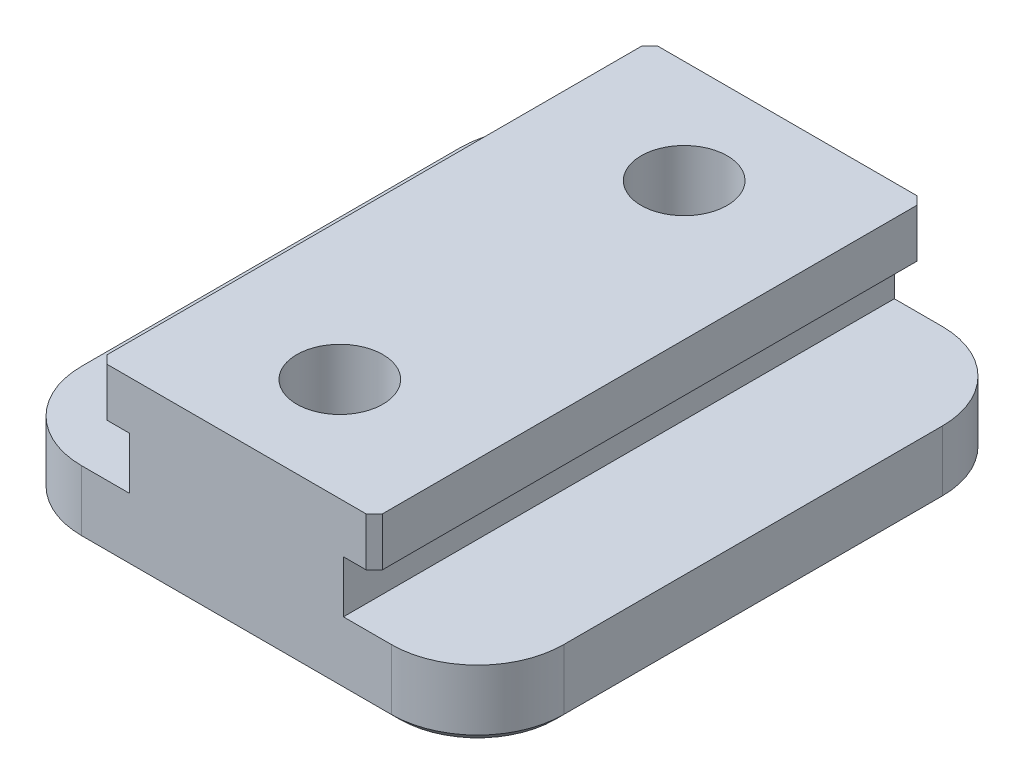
ISO-10303-21;
HEADER;
FILE_DESCRIPTION(('STEP AP214'),'2;1');
FILE_NAME('part.step','',(''),(''),'','','');
FILE_SCHEMA(('AUTOMOTIVE_DESIGN { 1 0 10303 214 1 1 1 1 }'));
ENDSEC;
DATA;
#1=APPLICATION_CONTEXT('core data for automotive mechanical design processes');
#2=APPLICATION_PROTOCOL_DEFINITION('international standard','automotive_design',2000,#1);
#3=PRODUCT_CONTEXT('',#1,'mechanical');
#4=PRODUCT('Part','Part','',(#3));
#5=PRODUCT_RELATED_PRODUCT_CATEGORY('part','',(#4));
#6=PRODUCT_DEFINITION_FORMATION('','',#4);
#7=PRODUCT_DEFINITION_CONTEXT('part definition',#1,'design');
#8=PRODUCT_DEFINITION('design','',#6,#7);
#9=PRODUCT_DEFINITION_SHAPE('','',#8);
#10=(LENGTH_UNIT() NAMED_UNIT(*) SI_UNIT(.MILLI.,.METRE.));
#11=(NAMED_UNIT(*) PLANE_ANGLE_UNIT() SI_UNIT($,.RADIAN.));
#12=(NAMED_UNIT(*) SI_UNIT($,.STERADIAN.) SOLID_ANGLE_UNIT());
#13=UNCERTAINTY_MEASURE_WITH_UNIT(LENGTH_MEASURE(1.E-05),#10,'distance_accuracy_value','');
#14=(GEOMETRIC_REPRESENTATION_CONTEXT(3) GLOBAL_UNCERTAINTY_ASSIGNED_CONTEXT((#13)) GLOBAL_UNIT_ASSIGNED_CONTEXT((#10,
#11,#12)) REPRESENTATION_CONTEXT('',''));
#15=CARTESIAN_POINT('',(0.,0.,0.));
#16=DIRECTION('',(0.,0.,1.));
#17=DIRECTION('',(1.,0.,0.));
#18=AXIS2_PLACEMENT_3D('',#15,#16,#17);
#19=CARTESIAN_POINT('',(-12.7,6.096,25.4));
#20=DIRECTION('',(1.,0.,0.));
#21=DIRECTION('',(0.,0.,-1.));
#22=AXIS2_PLACEMENT_3D('',#19,#20,#21);
#23=PLANE('',#22);
#24=DIRECTION('',(0.,0.,-1.));
#25=VECTOR('',#24,1.);
#26=CARTESIAN_POINT('',(-12.7,6.096,25.4));
#27=LINE('',#26,#25);
#28=CARTESIAN_POINT('',(-12.7,6.096,24.638));
#29=VERTEX_POINT('',#28);
#30=CARTESIAN_POINT('',(-12.7,6.096,-24.638));
#31=VERTEX_POINT('',#30);
#32=EDGE_CURVE('E239',#29,#31,#27,.T.);
#33=ORIENTED_EDGE('',*,*,#32,.T.);
#34=DIRECTION('',(0.,-1.,0.));
#35=VECTOR('',#34,1.);
#36=CARTESIAN_POINT('',(-12.7,6.096,-24.638));
#37=LINE('',#36,#35);
#38=CARTESIAN_POINT('',(-12.7,1.6256,-24.638));
#39=VERTEX_POINT('',#38);
#40=EDGE_CURVE('E385',#31,#39,#37,.T.);
#41=ORIENTED_EDGE('',*,*,#40,.T.);
#42=DIRECTION('',(0.,0.,-1.));
#43=VECTOR('',#42,1.);
#44=CARTESIAN_POINT('',(-12.7,1.6256,25.4));
#45=LINE('',#44,#43);
#46=CARTESIAN_POINT('',(-12.7,1.6256,24.638));
#47=VERTEX_POINT('',#46);
#48=EDGE_CURVE('E219',#47,#39,#45,.T.);
#49=ORIENTED_EDGE('',*,*,#48,.F.);
#50=DIRECTION('',(0.,1.,0.));
#51=VECTOR('',#50,1.);
#52=CARTESIAN_POINT('',(-12.7,6.096,24.638));
#53=LINE('',#52,#51);
#54=EDGE_CURVE('E383',#47,#29,#53,.T.);
#55=ORIENTED_EDGE('',*,*,#54,.T.);
#56=EDGE_LOOP('',(#33,#41,#49,#55));
#57=FACE_BOUND('',#56,.T.);
#58=ADVANCED_FACE('F39',(#57),#23,.F.);
#59=CARTESIAN_POINT('',(-12.7,1.6256,25.4));
#60=DIRECTION('',(0.,1.,0.));
#61=DIRECTION('',(-1.,0.,0.));
#62=AXIS2_PLACEMENT_3D('',#59,#60,#61);
#63=PLANE('',#62);
#64=ORIENTED_EDGE('',*,*,#48,.T.);
#65=DIRECTION('',(-0.707106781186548,0.,0.707106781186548));
#66=VECTOR('',#65,1.);
#67=CARTESIAN_POINT('',(-12.7,1.6256,-24.638));
#68=LINE('',#67,#66);
#69=CARTESIAN_POINT('',(-11.938,1.6256,-25.4));
#70=VERTEX_POINT('',#69);
#71=EDGE_CURVE('E61',#39,#70,#68,.F.);
#72=ORIENTED_EDGE('',*,*,#71,.T.);
#73=DIRECTION('',(1.,0.,0.));
#74=VECTOR('',#73,1.);
#75=CARTESIAN_POINT('',(-12.7,1.6256,-25.4));
#76=LINE('',#75,#74);
#77=CARTESIAN_POINT('',(-9.8552,1.6256,-25.4));
#78=VERTEX_POINT('',#77);
#79=EDGE_CURVE('E216',#70,#78,#76,.T.);
#80=ORIENTED_EDGE('',*,*,#79,.T.);
#81=DIRECTION('',(0.,0.,-1.));
#82=VECTOR('',#81,1.);
#83=CARTESIAN_POINT('',(-9.8552,1.6256,25.4));
#84=LINE('',#83,#82);
#85=CARTESIAN_POINT('',(-9.8552,1.6256,25.4));
#86=VERTEX_POINT('',#85);
#87=EDGE_CURVE('E212',#86,#78,#84,.T.);
#88=ORIENTED_EDGE('',*,*,#87,.F.);
#89=DIRECTION('',(1.,0.,0.));
#90=VECTOR('',#89,1.);
#91=CARTESIAN_POINT('',(-12.7,1.6256,25.4));
#92=LINE('',#91,#90);
#93=CARTESIAN_POINT('',(-11.938,1.6256,25.4));
#94=VERTEX_POINT('',#93);
#95=EDGE_CURVE('E200',#94,#86,#92,.T.);
#96=ORIENTED_EDGE('',*,*,#95,.F.);
#97=DIRECTION('',(-0.707106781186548,0.,-0.707106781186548));
#98=VECTOR('',#97,1.);
#99=CARTESIAN_POINT('',(-11.938,1.6256,25.4));
#100=LINE('',#99,#98);
#101=EDGE_CURVE('E54',#94,#47,#100,.T.);
#102=ORIENTED_EDGE('',*,*,#101,.T.);
#103=EDGE_LOOP('',(#64,#72,#80,#88,#96,#102));
#104=FACE_BOUND('',#103,.T.);
#105=ADVANCED_FACE('F214',(#104),#63,.F.);
#106=CARTESIAN_POINT('',(-9.8552,1.6256,25.4));
#107=DIRECTION('',(1.,0.,0.));
#108=DIRECTION('',(0.,1.,0.));
#109=AXIS2_PLACEMENT_3D('',#106,#107,#108);
#110=PLANE('',#109);
#111=DIRECTION('',(0.,-1.,0.));
#112=VECTOR('',#111,1.);
#113=CARTESIAN_POINT('',(-9.8552,1.6256,-25.4));
#114=LINE('',#113,#112);
#115=CARTESIAN_POINT('',(-9.8552,-3.175,-25.4));
#116=VERTEX_POINT('',#115);
#117=EDGE_CURVE('E241',#78,#116,#114,.T.);
#118=ORIENTED_EDGE('',*,*,#117,.T.);
#119=DIRECTION('',(0.,0.,-1.));
#120=VECTOR('',#119,1.);
#121=CARTESIAN_POINT('',(-9.8552,-3.175,25.4));
#122=LINE('',#121,#120);
#123=CARTESIAN_POINT('',(-9.8552,-3.175,25.4));
#124=VERTEX_POINT('',#123);
#125=EDGE_CURVE('E220',#124,#116,#122,.T.);
#126=ORIENTED_EDGE('',*,*,#125,.F.);
#127=DIRECTION('',(0.,-1.,0.));
#128=VECTOR('',#127,1.);
#129=CARTESIAN_POINT('',(-9.8552,1.6256,25.4));
#130=LINE('',#129,#128);
#131=EDGE_CURVE('E206',#86,#124,#130,.T.);
#132=ORIENTED_EDGE('',*,*,#131,.F.);
#133=ORIENTED_EDGE('',*,*,#87,.T.);
#134=EDGE_LOOP('',(#118,#126,#132,#133));
#135=FACE_BOUND('',#134,.T.);
#136=ADVANCED_FACE('F222',(#135),#110,.F.);
#137=CARTESIAN_POINT('',(-9.8552,-3.175,25.4));
#138=DIRECTION('',(0.,-1.,0.));
#139=DIRECTION('',(1.,0.,0.));
#140=AXIS2_PLACEMENT_3D('',#137,#138,#139);
#141=PLANE('',#140);
#142=DIRECTION('',(0.,0.,-1.));
#143=VECTOR('',#142,1.);
#144=CARTESIAN_POINT('',(-22.225,-3.175,25.4));
#145=LINE('',#144,#143);
#146=CARTESIAN_POINT('',(-22.225,-3.175,17.4498));
#147=VERTEX_POINT('',#146);
#148=CARTESIAN_POINT('',(-22.225,-3.175,-17.4498));
#149=VERTEX_POINT('',#148);
#150=EDGE_CURVE('E273',#147,#149,#145,.T.);
#151=ORIENTED_EDGE('',*,*,#150,.F.);
#152=CARTESIAN_POINT('',(-14.2748,-3.175,17.4498));
#153=DIRECTION('',(0.,-1.,0.));
#154=DIRECTION('',(1.,0.,0.));
#155=AXIS2_PLACEMENT_3D('',#152,#153,#154);
#156=CIRCLE('',#155,7.9502);
#157=CARTESIAN_POINT('',(-14.2748,-3.175,25.4));
#158=VERTEX_POINT('',#157);
#159=EDGE_CURVE('E290',#147,#158,#156,.F.);
#160=ORIENTED_EDGE('',*,*,#159,.T.);
#161=DIRECTION('',(-1.,0.,0.));
#162=VECTOR('',#161,1.);
#163=CARTESIAN_POINT('',(-9.8552,-3.175,25.4));
#164=LINE('',#163,#162);
#165=EDGE_CURVE('E225',#124,#158,#164,.T.);
#166=ORIENTED_EDGE('',*,*,#165,.F.);
#167=ORIENTED_EDGE('',*,*,#125,.T.);
#168=DIRECTION('',(-1.,0.,0.));
#169=VECTOR('',#168,1.);
#170=CARTESIAN_POINT('',(-9.8552,-3.175,-25.4));
#171=LINE('',#170,#169);
#172=CARTESIAN_POINT('',(-14.2748,-3.175,-25.4));
#173=VERTEX_POINT('',#172);
#174=EDGE_CURVE('E244',#116,#173,#171,.T.);
#175=ORIENTED_EDGE('',*,*,#174,.T.);
#176=CARTESIAN_POINT('',(-14.2748,-3.175,-17.4498));
#177=DIRECTION('',(0.,-1.,0.));
#178=DIRECTION('',(1.,0.,0.));
#179=AXIS2_PLACEMENT_3D('',#176,#177,#178);
#180=CIRCLE('',#179,7.9502);
#181=EDGE_CURVE('E288',#173,#149,#180,.F.);
#182=ORIENTED_EDGE('',*,*,#181,.T.);
#183=EDGE_LOOP('',(#151,#160,#166,#167,#175,#182));
#184=FACE_BOUND('',#183,.T.);
#185=ADVANCED_FACE('F765',(#184),#141,.F.);
#186=CARTESIAN_POINT('',(-22.225,-3.175,25.4));
#187=DIRECTION('',(1.,0.,0.));
#188=DIRECTION('',(0.,0.,-1.));
#189=AXIS2_PLACEMENT_3D('',#186,#187,#188);
#190=PLANE('',#189);
#191=DIRECTION('',(0.,-1.,0.));
#192=VECTOR('',#191,1.);
#193=CARTESIAN_POINT('',(-22.225,-3.175,-17.4498));
#194=LINE('',#193,#192);
#195=CARTESIAN_POINT('',(-22.225,-8.763,-17.4498));
#196=VERTEX_POINT('',#195);
#197=EDGE_CURVE('E283',#149,#196,#194,.T.);
#198=ORIENTED_EDGE('',*,*,#197,.T.);
#199=DIRECTION('',(0.,0.,1.));
#200=VECTOR('',#199,1.);
#201=CARTESIAN_POINT('',(-22.225,-8.763,25.4));
#202=LINE('',#201,#200);
#203=CARTESIAN_POINT('',(-22.225,-8.763,17.4498));
#204=VERTEX_POINT('',#203);
#205=EDGE_CURVE('E330',#196,#204,#202,.T.);
#206=ORIENTED_EDGE('',*,*,#205,.T.);
#207=DIRECTION('',(0.,-1.,0.));
#208=VECTOR('',#207,1.);
#209=CARTESIAN_POINT('',(-22.225,-3.175,17.4498));
#210=LINE('',#209,#208);
#211=EDGE_CURVE('E286',#204,#147,#210,.F.);
#212=ORIENTED_EDGE('',*,*,#211,.T.);
#213=ORIENTED_EDGE('',*,*,#150,.T.);
#214=EDGE_LOOP('',(#198,#206,#212,#213));
#215=FACE_BOUND('',#214,.T.);
#216=ADVANCED_FACE('F463',(#215),#190,.F.);
#217=CARTESIAN_POINT('',(-22.225,-9.525,25.4));
#218=DIRECTION('',(0.,1.,0.));
#219=DIRECTION('',(0.,0.,1.));
#220=AXIS2_PLACEMENT_3D('',#217,#218,#219);
#221=PLANE('',#220);
#222=CARTESIAN_POINT('',(0.,-9.525,15.875));
#223=DIRECTION('',(0.,-1.,0.));
#224=DIRECTION('',(0.,0.,-1.));
#225=AXIS2_PLACEMENT_3D('',#222,#223,#224);
#226=CIRCLE('',#225,3.96875);
#227=CARTESIAN_POINT('',(0.,-9.525,11.90625));
#228=VERTEX_POINT('',#227);
#229=EDGE_CURVE('E831',#228,#228,#226,.T.);
#230=ORIENTED_EDGE('',*,*,#229,.F.);
#231=EDGE_LOOP('',(#230));
#232=FACE_BOUND('',#231,.T.);
#233=CARTESIAN_POINT('',(0.,-9.525,-15.875));
#234=DIRECTION('',(0.,-1.,0.));
#235=DIRECTION('',(0.,0.,-1.));
#236=AXIS2_PLACEMENT_3D('',#233,#234,#235);
#237=CIRCLE('',#236,3.96875);
#238=CARTESIAN_POINT('',(0.,-9.525,-19.84375));
#239=VERTEX_POINT('',#238);
#240=EDGE_CURVE('E834',#239,#239,#237,.T.);
#241=ORIENTED_EDGE('',*,*,#240,.F.);
#242=EDGE_LOOP('',(#241));
#243=FACE_BOUND('',#242,.T.);
#244=CARTESIAN_POINT('',(-14.2748,-9.525,-17.4498));
#245=DIRECTION('',(0.,1.,0.));
#246=DIRECTION('',(0.,0.,1.));
#247=AXIS2_PLACEMENT_3D('',#244,#245,#246);
#248=CIRCLE('',#247,7.1882);
#249=CARTESIAN_POINT('',(-21.463,-9.525,-17.4498));
#250=VERTEX_POINT('',#249);
#251=CARTESIAN_POINT('',(-14.2748,-9.525,-24.638));
#252=VERTEX_POINT('',#251);
#253=EDGE_CURVE('E318',#250,#252,#248,.F.);
#254=ORIENTED_EDGE('',*,*,#253,.T.);
#255=DIRECTION('',(1.,0.,0.));
#256=VECTOR('',#255,1.);
#257=CARTESIAN_POINT('',(-22.225,-9.525,-24.638));
#258=LINE('',#257,#256);
#259=CARTESIAN_POINT('',(14.2748,-9.525,-24.638));
#260=VERTEX_POINT('',#259);
#261=EDGE_CURVE('E320',#252,#260,#258,.T.);
#262=ORIENTED_EDGE('',*,*,#261,.T.);
#263=CARTESIAN_POINT('',(14.2748,-9.525,-17.4498));
#264=DIRECTION('',(0.,1.,0.));
#265=DIRECTION('',(0.,0.,1.));
#266=AXIS2_PLACEMENT_3D('',#263,#264,#265);
#267=CIRCLE('',#266,7.1882);
#268=CARTESIAN_POINT('',(21.463,-9.525,-17.4498));
#269=VERTEX_POINT('',#268);
#270=EDGE_CURVE('E316',#260,#269,#267,.F.);
#271=ORIENTED_EDGE('',*,*,#270,.T.);
#272=DIRECTION('',(0.,0.,1.));
#273=VECTOR('',#272,1.);
#274=CARTESIAN_POINT('',(21.463,-9.525,25.4));
#275=LINE('',#274,#273);
#276=CARTESIAN_POINT('',(21.463,-9.525,17.4498));
#277=VERTEX_POINT('',#276);
#278=EDGE_CURVE('E312',#269,#277,#275,.T.);
#279=ORIENTED_EDGE('',*,*,#278,.T.);
#280=CARTESIAN_POINT('',(14.2748,-9.525,17.4498));
#281=DIRECTION('',(0.,1.,0.));
#282=DIRECTION('',(0.,0.,1.));
#283=AXIS2_PLACEMENT_3D('',#280,#281,#282);
#284=CIRCLE('',#283,7.1882);
#285=CARTESIAN_POINT('',(14.2748,-9.525,24.638));
#286=VERTEX_POINT('',#285);
#287=EDGE_CURVE('E308',#277,#286,#284,.F.);
#288=ORIENTED_EDGE('',*,*,#287,.T.);
#289=DIRECTION('',(-1.,0.,0.));
#290=VECTOR('',#289,1.);
#291=CARTESIAN_POINT('',(-14.2748,-9.525,24.638));
#292=LINE('',#291,#290);
#293=CARTESIAN_POINT('',(-14.2748,-9.525,24.638));
#294=VERTEX_POINT('',#293);
#295=EDGE_CURVE('E306',#286,#294,#292,.T.);
#296=ORIENTED_EDGE('',*,*,#295,.T.);
#297=CARTESIAN_POINT('',(-14.2748,-9.525,17.4498));
#298=DIRECTION('',(0.,1.,0.));
#299=DIRECTION('',(0.,0.,1.));
#300=AXIS2_PLACEMENT_3D('',#297,#298,#299);
#301=CIRCLE('',#300,7.1882);
#302=CARTESIAN_POINT('',(-21.463,-9.525,17.4498));
#303=VERTEX_POINT('',#302);
#304=EDGE_CURVE('E310',#294,#303,#301,.F.);
#305=ORIENTED_EDGE('',*,*,#304,.T.);
#306=DIRECTION('',(0.,0.,-1.));
#307=VECTOR('',#306,1.);
#308=CARTESIAN_POINT('',(-21.463,-9.525,25.4));
#309=LINE('',#308,#307);
#310=EDGE_CURVE('E314',#303,#250,#309,.T.);
#311=ORIENTED_EDGE('',*,*,#310,.T.);
#312=EDGE_LOOP('',(#254,#262,#271,#279,#288,#296,#305,#311));
#313=FACE_BOUND('',#312,.T.);
#314=ADVANCED_FACE('F451',(#232,#243,#313),#221,.F.);
#315=CARTESIAN_POINT('',(22.225,-3.175,25.4));
#316=DIRECTION('',(-1.,0.,0.));
#317=DIRECTION('',(0.,0.,1.));
#318=AXIS2_PLACEMENT_3D('',#315,#316,#317);
#319=PLANE('',#318);
#320=DIRECTION('',(0.,1.,0.));
#321=VECTOR('',#320,1.);
#322=CARTESIAN_POINT('',(22.225,-9.525,17.4498));
#323=LINE('',#322,#321);
#324=CARTESIAN_POINT('',(22.225,-3.175,17.4498));
#325=VERTEX_POINT('',#324);
#326=CARTESIAN_POINT('',(22.225,-8.763,17.4498));
#327=VERTEX_POINT('',#326);
#328=EDGE_CURVE('E297',#325,#327,#323,.F.);
#329=ORIENTED_EDGE('',*,*,#328,.T.);
#330=DIRECTION('',(0.,0.,-1.));
#331=VECTOR('',#330,1.);
#332=CARTESIAN_POINT('',(22.225,-8.763,25.4));
#333=LINE('',#332,#331);
#334=CARTESIAN_POINT('',(22.225,-8.763,-17.4498));
#335=VERTEX_POINT('',#334);
#336=EDGE_CURVE('E332',#327,#335,#333,.T.);
#337=ORIENTED_EDGE('',*,*,#336,.T.);
#338=DIRECTION('',(0.,1.,0.));
#339=VECTOR('',#338,1.);
#340=CARTESIAN_POINT('',(22.225,-3.175,-17.4498));
#341=LINE('',#340,#339);
#342=CARTESIAN_POINT('',(22.225,-3.175,-17.4498));
#343=VERTEX_POINT('',#342);
#344=EDGE_CURVE('E300',#335,#343,#341,.T.);
#345=ORIENTED_EDGE('',*,*,#344,.T.);
#346=DIRECTION('',(0.,0.,-1.));
#347=VECTOR('',#346,1.);
#348=CARTESIAN_POINT('',(22.225,-3.175,25.4));
#349=LINE('',#348,#347);
#350=EDGE_CURVE('E270',#325,#343,#349,.T.);
#351=ORIENTED_EDGE('',*,*,#350,.F.);
#352=EDGE_LOOP('',(#329,#337,#345,#351));
#353=FACE_BOUND('',#352,.T.);
#354=ADVANCED_FACE('F495',(#353),#319,.F.);
#355=CARTESIAN_POINT('',(9.8552,-3.175,25.4));
#356=DIRECTION('',(0.,-1.,0.));
#357=DIRECTION('',(1.,0.,0.));
#358=AXIS2_PLACEMENT_3D('',#355,#356,#357);
#359=PLANE('',#358);
#360=ORIENTED_EDGE('',*,*,#350,.T.);
#361=CARTESIAN_POINT('',(14.2748,-3.175,-17.4498));
#362=DIRECTION('',(0.,-1.,0.));
#363=DIRECTION('',(1.,0.,0.));
#364=AXIS2_PLACEMENT_3D('',#361,#362,#363);
#365=CIRCLE('',#364,7.9502);
#366=CARTESIAN_POINT('',(14.2748,-3.175,-25.4));
#367=VERTEX_POINT('',#366);
#368=EDGE_CURVE('E304',#343,#367,#365,.F.);
#369=ORIENTED_EDGE('',*,*,#368,.T.);
#370=DIRECTION('',(-1.,0.,0.));
#371=VECTOR('',#370,1.);
#372=CARTESIAN_POINT('',(9.8552,-3.175,-25.4));
#373=LINE('',#372,#371);
#374=CARTESIAN_POINT('',(9.8552,-3.175,-25.4));
#375=VERTEX_POINT('',#374);
#376=EDGE_CURVE('E247',#367,#375,#373,.T.);
#377=ORIENTED_EDGE('',*,*,#376,.T.);
#378=DIRECTION('',(0.,0.,-1.));
#379=VECTOR('',#378,1.);
#380=CARTESIAN_POINT('',(9.8552,-3.175,25.4));
#381=LINE('',#380,#379);
#382=CARTESIAN_POINT('',(9.8552,-3.175,25.4));
#383=VERTEX_POINT('',#382);
#384=EDGE_CURVE('E267',#383,#375,#381,.T.);
#385=ORIENTED_EDGE('',*,*,#384,.F.);
#386=DIRECTION('',(-1.,0.,0.));
#387=VECTOR('',#386,1.);
#388=CARTESIAN_POINT('',(9.8552,-3.175,25.4));
#389=LINE('',#388,#387);
#390=CARTESIAN_POINT('',(14.2748,-3.175,25.4));
#391=VERTEX_POINT('',#390);
#392=EDGE_CURVE('E227',#391,#383,#389,.T.);
#393=ORIENTED_EDGE('',*,*,#392,.F.);
#394=CARTESIAN_POINT('',(14.2748,-3.175,17.4498));
#395=DIRECTION('',(0.,-1.,0.));
#396=DIRECTION('',(1.,0.,0.));
#397=AXIS2_PLACEMENT_3D('',#394,#395,#396);
#398=CIRCLE('',#397,7.9502);
#399=EDGE_CURVE('E302',#391,#325,#398,.F.);
#400=ORIENTED_EDGE('',*,*,#399,.T.);
#401=EDGE_LOOP('',(#360,#369,#377,#385,#393,#400));
#402=FACE_BOUND('',#401,.T.);
#403=ADVANCED_FACE('F430',(#402),#359,.F.);
#404=CARTESIAN_POINT('',(9.8552,1.6256,25.4));
#405=DIRECTION('',(-1.,0.,0.));
#406=DIRECTION('',(0.,-1.,0.));
#407=AXIS2_PLACEMENT_3D('',#404,#405,#406);
#408=PLANE('',#407);
#409=DIRECTION('',(0.,1.,0.));
#410=VECTOR('',#409,1.);
#411=CARTESIAN_POINT('',(9.8552,1.6256,-25.4));
#412=LINE('',#411,#410);
#413=CARTESIAN_POINT('',(9.8552,1.6256,-25.4));
#414=VERTEX_POINT('',#413);
#415=EDGE_CURVE('E249',#375,#414,#412,.T.);
#416=ORIENTED_EDGE('',*,*,#415,.T.);
#417=DIRECTION('',(0.,0.,-1.));
#418=VECTOR('',#417,1.);
#419=CARTESIAN_POINT('',(9.8552,1.6256,25.4));
#420=LINE('',#419,#418);
#421=CARTESIAN_POINT('',(9.8552,1.6256,25.4));
#422=VERTEX_POINT('',#421);
#423=EDGE_CURVE('E264',#422,#414,#420,.T.);
#424=ORIENTED_EDGE('',*,*,#423,.F.);
#425=DIRECTION('',(0.,1.,0.));
#426=VECTOR('',#425,1.);
#427=CARTESIAN_POINT('',(9.8552,1.6256,25.4));
#428=LINE('',#427,#426);
#429=EDGE_CURVE('E232',#383,#422,#428,.T.);
#430=ORIENTED_EDGE('',*,*,#429,.F.);
#431=ORIENTED_EDGE('',*,*,#384,.T.);
#432=EDGE_LOOP('',(#416,#424,#430,#431));
#433=FACE_BOUND('',#432,.T.);
#434=ADVANCED_FACE('F426',(#433),#408,.F.);
#435=CARTESIAN_POINT('',(12.7,1.6256,25.4));
#436=DIRECTION('',(0.,1.,0.));
#437=DIRECTION('',(0.,0.,1.));
#438=AXIS2_PLACEMENT_3D('',#435,#436,#437);
#439=PLANE('',#438);
#440=DIRECTION('',(1.,0.,0.));
#441=VECTOR('',#440,1.);
#442=CARTESIAN_POINT('',(12.7,1.6256,-25.4));
#443=LINE('',#442,#441);
#444=CARTESIAN_POINT('',(11.938,1.6256,-25.4));
#445=VERTEX_POINT('',#444);
#446=EDGE_CURVE('E251',#414,#445,#443,.T.);
#447=ORIENTED_EDGE('',*,*,#446,.T.);
#448=DIRECTION('',(-0.707106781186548,0.,-0.707106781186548));
#449=VECTOR('',#448,1.);
#450=CARTESIAN_POINT('',(12.7,1.6256,-24.638));
#451=LINE('',#450,#449);
#452=CARTESIAN_POINT('',(12.7,1.6256,-24.638));
#453=VERTEX_POINT('',#452);
#454=EDGE_CURVE('E381',#445,#453,#451,.F.);
#455=ORIENTED_EDGE('',*,*,#454,.T.);
#456=DIRECTION('',(0.,0.,-1.));
#457=VECTOR('',#456,1.);
#458=CARTESIAN_POINT('',(12.7,1.6256,25.4));
#459=LINE('',#458,#457);
#460=CARTESIAN_POINT('',(12.7,1.6256,24.638));
#461=VERTEX_POINT('',#460);
#462=EDGE_CURVE('E261',#461,#453,#459,.T.);
#463=ORIENTED_EDGE('',*,*,#462,.F.);
#464=DIRECTION('',(-0.707106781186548,0.,0.707106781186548));
#465=VECTOR('',#464,1.);
#466=CARTESIAN_POINT('',(11.938,1.6256,25.4));
#467=LINE('',#466,#465);
#468=CARTESIAN_POINT('',(11.938,1.6256,25.4));
#469=VERTEX_POINT('',#468);
#470=EDGE_CURVE('E379',#461,#469,#467,.T.);
#471=ORIENTED_EDGE('',*,*,#470,.T.);
#472=DIRECTION('',(1.,0.,0.));
#473=VECTOR('',#472,1.);
#474=CARTESIAN_POINT('',(12.7,1.6256,25.4));
#475=LINE('',#474,#473);
#476=EDGE_CURVE('E234',#422,#469,#475,.T.);
#477=ORIENTED_EDGE('',*,*,#476,.F.);
#478=ORIENTED_EDGE('',*,*,#423,.T.);
#479=EDGE_LOOP('',(#447,#455,#463,#471,#477,#478));
#480=FACE_BOUND('',#479,.T.);
#481=ADVANCED_FACE('F416',(#480),#439,.F.);
#482=CARTESIAN_POINT('',(12.7,6.096,25.4));
#483=DIRECTION('',(-1.,0.,0.));
#484=DIRECTION('',(0.,0.,1.));
#485=AXIS2_PLACEMENT_3D('',#482,#483,#484);
#486=PLANE('',#485);
#487=ORIENTED_EDGE('',*,*,#462,.T.);
#488=DIRECTION('',(0.,1.,0.));
#489=VECTOR('',#488,1.);
#490=CARTESIAN_POINT('',(12.7,6.096,-24.638));
#491=LINE('',#490,#489);
#492=CARTESIAN_POINT('',(12.7,6.096,-24.638));
#493=VERTEX_POINT('',#492);
#494=EDGE_CURVE('E364',#453,#493,#491,.T.);
#495=ORIENTED_EDGE('',*,*,#494,.T.);
#496=DIRECTION('',(0.,0.,-1.));
#497=VECTOR('',#496,1.);
#498=CARTESIAN_POINT('',(12.7,6.096,25.4));
#499=LINE('',#498,#497);
#500=CARTESIAN_POINT('',(12.7,6.096,24.638));
#501=VERTEX_POINT('',#500);
#502=EDGE_CURVE('E258',#501,#493,#499,.T.);
#503=ORIENTED_EDGE('',*,*,#502,.F.);
#504=DIRECTION('',(0.,-1.,0.));
#505=VECTOR('',#504,1.);
#506=CARTESIAN_POINT('',(12.7,1.6256,24.638));
#507=LINE('',#506,#505);
#508=EDGE_CURVE('E340',#501,#461,#507,.T.);
#509=ORIENTED_EDGE('',*,*,#508,.T.);
#510=EDGE_LOOP('',(#487,#495,#503,#509));
#511=FACE_BOUND('',#510,.T.);
#512=ADVANCED_FACE('F418',(#511),#486,.F.);
#513=CARTESIAN_POINT('',(12.7,6.096,25.4));
#514=DIRECTION('',(0.,-1.,0.));
#515=DIRECTION('',(0.,0.,-1.));
#516=AXIS2_PLACEMENT_3D('',#513,#514,#515);
#517=PLANE('',#516);
#518=CARTESIAN_POINT('',(0.,6.096,15.875));
#519=DIRECTION('',(0.,-1.,0.));
#520=DIRECTION('',(0.,0.,-1.));
#521=AXIS2_PLACEMENT_3D('',#518,#519,#520);
#522=CIRCLE('',#521,3.96875);
#523=CARTESIAN_POINT('',(0.,6.096,11.90625));
#524=VERTEX_POINT('',#523);
#525=EDGE_CURVE('E836',#524,#524,#522,.T.);
#526=ORIENTED_EDGE('',*,*,#525,.T.);
#527=EDGE_LOOP('',(#526));
#528=FACE_BOUND('',#527,.T.);
#529=CARTESIAN_POINT('',(0.,6.096,-15.875));
#530=DIRECTION('',(0.,-1.,0.));
#531=DIRECTION('',(0.,0.,-1.));
#532=AXIS2_PLACEMENT_3D('',#529,#530,#531);
#533=CIRCLE('',#532,3.96875);
#534=CARTESIAN_POINT('',(0.,6.096,-19.84375));
#535=VERTEX_POINT('',#534);
#536=EDGE_CURVE('E344',#535,#535,#533,.T.);
#537=ORIENTED_EDGE('',*,*,#536,.T.);
#538=EDGE_LOOP('',(#537));
#539=FACE_BOUND('',#538,.T.);
#540=ORIENTED_EDGE('',*,*,#502,.T.);
#541=DIRECTION('',(0.707106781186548,0.,0.707106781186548));
#542=VECTOR('',#541,1.);
#543=CARTESIAN_POINT('',(12.7,6.096,-24.638));
#544=LINE('',#543,#542);
#545=CARTESIAN_POINT('',(11.938,6.096,-25.4));
#546=VERTEX_POINT('',#545);
#547=EDGE_CURVE('E373',#493,#546,#544,.F.);
#548=ORIENTED_EDGE('',*,*,#547,.T.);
#549=DIRECTION('',(-1.,0.,0.));
#550=VECTOR('',#549,1.);
#551=CARTESIAN_POINT('',(12.7,6.096,-25.4));
#552=LINE('',#551,#550);
#553=CARTESIAN_POINT('',(-11.938,6.096,-25.4));
#554=VERTEX_POINT('',#553);
#555=EDGE_CURVE('E209',#546,#554,#552,.T.);
#556=ORIENTED_EDGE('',*,*,#555,.T.);
#557=DIRECTION('',(0.707106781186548,0.,-0.707106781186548));
#558=VECTOR('',#557,1.);
#559=CARTESIAN_POINT('',(-12.7,6.096,-24.638));
#560=LINE('',#559,#558);
#561=EDGE_CURVE('E371',#554,#31,#560,.F.);
#562=ORIENTED_EDGE('',*,*,#561,.T.);
#563=ORIENTED_EDGE('',*,*,#32,.F.);
#564=DIRECTION('',(0.707106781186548,0.,0.707106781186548));
#565=VECTOR('',#564,1.);
#566=CARTESIAN_POINT('',(-11.938,6.096,25.4));
#567=LINE('',#566,#565);
#568=CARTESIAN_POINT('',(-11.938,6.096,25.4));
#569=VERTEX_POINT('',#568);
#570=EDGE_CURVE('E369',#29,#569,#567,.T.);
#571=ORIENTED_EDGE('',*,*,#570,.T.);
#572=DIRECTION('',(-1.,0.,0.));
#573=VECTOR('',#572,1.);
#574=CARTESIAN_POINT('',(12.7,6.096,25.4));
#575=LINE('',#574,#573);
#576=CARTESIAN_POINT('',(11.938,6.096,25.4));
#577=VERTEX_POINT('',#576);
#578=EDGE_CURVE('E237',#577,#569,#575,.T.);
#579=ORIENTED_EDGE('',*,*,#578,.F.);
#580=DIRECTION('',(0.707106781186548,0.,-0.707106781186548));
#581=VECTOR('',#580,1.);
#582=CARTESIAN_POINT('',(11.938,6.096,25.4));
#583=LINE('',#582,#581);
#584=EDGE_CURVE('E367',#577,#501,#583,.T.);
#585=ORIENTED_EDGE('',*,*,#584,.T.);
#586=EDGE_LOOP('',(#540,#548,#556,#562,#563,#571,#579,#585));
#587=FACE_BOUND('',#586,.T.);
#588=ADVANCED_FACE('F395',(#528,#539,#587),#517,.F.);
#589=CARTESIAN_POINT('',(0.,0.,25.4));
#590=DIRECTION('',(0.,0.,1.));
#591=DIRECTION('',(1.,0.,0.));
#592=AXIS2_PLACEMENT_3D('',#589,#590,#591);
#593=PLANE('',#592);
#594=ORIENTED_EDGE('',*,*,#578,.T.);
#595=DIRECTION('',(0.,-1.,0.));
#596=VECTOR('',#595,1.);
#597=CARTESIAN_POINT('',(-11.938,1.6256,25.4));
#598=LINE('',#597,#596);
#599=EDGE_CURVE('E11',#569,#94,#598,.T.);
#600=ORIENTED_EDGE('',*,*,#599,.T.);
#601=ORIENTED_EDGE('',*,*,#95,.T.);
#602=ORIENTED_EDGE('',*,*,#131,.T.);
#603=ORIENTED_EDGE('',*,*,#165,.T.);
#604=DIRECTION('',(0.,-1.,0.));
#605=VECTOR('',#604,1.);
#606=CARTESIAN_POINT('',(-14.2748,-9.525,25.4));
#607=LINE('',#606,#605);
#608=CARTESIAN_POINT('',(-14.2748,-8.763,25.4));
#609=VERTEX_POINT('',#608);
#610=EDGE_CURVE('E280',#158,#609,#607,.T.);
#611=ORIENTED_EDGE('',*,*,#610,.T.);
#612=DIRECTION('',(1.,0.,0.));
#613=VECTOR('',#612,1.);
#614=CARTESIAN_POINT('',(14.2748,-8.763,25.4));
#615=LINE('',#614,#613);
#616=CARTESIAN_POINT('',(14.2748,-8.763,25.4));
#617=VERTEX_POINT('',#616);
#618=EDGE_CURVE('E338',#609,#617,#615,.T.);
#619=ORIENTED_EDGE('',*,*,#618,.T.);
#620=DIRECTION('',(0.,1.,0.));
#621=VECTOR('',#620,1.);
#622=CARTESIAN_POINT('',(14.2748,-3.175,25.4));
#623=LINE('',#622,#621);
#624=EDGE_CURVE('E278',#617,#391,#623,.T.);
#625=ORIENTED_EDGE('',*,*,#624,.T.);
#626=ORIENTED_EDGE('',*,*,#392,.T.);
#627=ORIENTED_EDGE('',*,*,#429,.T.);
#628=ORIENTED_EDGE('',*,*,#476,.T.);
#629=DIRECTION('',(0.,1.,0.));
#630=VECTOR('',#629,1.);
#631=CARTESIAN_POINT('',(11.938,6.096,25.4));
#632=LINE('',#631,#630);
#633=EDGE_CURVE('E47',#469,#577,#632,.T.);
#634=ORIENTED_EDGE('',*,*,#633,.T.);
#635=EDGE_LOOP('',(#594,#600,#601,#602,#603,#611,#619,#625,#626,#627,#628,#634));
#636=FACE_BOUND('',#635,.T.);
#637=ADVANCED_FACE('F203',(#636),#593,.T.);
#638=CARTESIAN_POINT('',(0.,0.,-25.4));
#639=DIRECTION('',(0.,0.,1.));
#640=DIRECTION('',(1.,0.,0.));
#641=AXIS2_PLACEMENT_3D('',#638,#639,#640);
#642=PLANE('',#641);
#643=ORIENTED_EDGE('',*,*,#555,.F.);
#644=DIRECTION('',(0.,-1.,0.));
#645=VECTOR('',#644,1.);
#646=CARTESIAN_POINT('',(11.938,0.,-25.4));
#647=LINE('',#646,#645);
#648=EDGE_CURVE('E377',#546,#445,#647,.T.);
#649=ORIENTED_EDGE('',*,*,#648,.T.);
#650=ORIENTED_EDGE('',*,*,#446,.F.);
#651=ORIENTED_EDGE('',*,*,#415,.F.);
#652=ORIENTED_EDGE('',*,*,#376,.F.);
#653=DIRECTION('',(0.,1.,0.));
#654=VECTOR('',#653,1.);
#655=CARTESIAN_POINT('',(14.2748,0.,-25.4));
#656=LINE('',#655,#654);
#657=CARTESIAN_POINT('',(14.2748,-8.763,-25.4));
#658=VERTEX_POINT('',#657);
#659=EDGE_CURVE('E292',#367,#658,#656,.F.);
#660=ORIENTED_EDGE('',*,*,#659,.T.);
#661=DIRECTION('',(-1.,0.,0.));
#662=VECTOR('',#661,1.);
#663=CARTESIAN_POINT('',(0.,-8.763,-25.4));
#664=LINE('',#663,#662);
#665=CARTESIAN_POINT('',(-14.2748,-8.763,-25.4));
#666=VERTEX_POINT('',#665);
#667=EDGE_CURVE('E323',#658,#666,#664,.T.);
#668=ORIENTED_EDGE('',*,*,#667,.T.);
#669=DIRECTION('',(0.,-1.,0.));
#670=VECTOR('',#669,1.);
#671=CARTESIAN_POINT('',(-14.2748,0.,-25.4));
#672=LINE('',#671,#670);
#673=EDGE_CURVE('E295',#666,#173,#672,.F.);
#674=ORIENTED_EDGE('',*,*,#673,.T.);
#675=ORIENTED_EDGE('',*,*,#174,.F.);
#676=ORIENTED_EDGE('',*,*,#117,.F.);
#677=ORIENTED_EDGE('',*,*,#79,.F.);
#678=DIRECTION('',(0.,1.,0.));
#679=VECTOR('',#678,1.);
#680=CARTESIAN_POINT('',(-11.938,0.,-25.4));
#681=LINE('',#680,#679);
#682=EDGE_CURVE('E375',#70,#554,#681,.T.);
#683=ORIENTED_EDGE('',*,*,#682,.T.);
#684=EDGE_LOOP('',(#643,#649,#650,#651,#652,#660,#668,#674,#675,#676,#677,#683));
#685=FACE_BOUND('',#684,.T.);
#686=ADVANCED_FACE('F404',(#685),#642,.F.);
#687=CARTESIAN_POINT('',(-14.2748,0.,17.4498));
#688=DIRECTION('',(0.,1.,0.));
#689=DIRECTION('',(0.,0.,1.));
#690=AXIS2_PLACEMENT_3D('',#687,#688,#689);
#691=CYLINDRICAL_SURFACE('',#690,7.9502);
#692=ORIENTED_EDGE('',*,*,#211,.F.);
#693=CARTESIAN_POINT('',(-14.2748,-8.763,17.4498));
#694=DIRECTION('',(0.,1.,0.));
#695=DIRECTION('',(0.,0.,1.));
#696=AXIS2_PLACEMENT_3D('',#693,#694,#695);
#697=CIRCLE('',#696,7.9502);
#698=EDGE_CURVE('E334',#204,#609,#697,.T.);
#699=ORIENTED_EDGE('',*,*,#698,.T.);
#700=ORIENTED_EDGE('',*,*,#610,.F.);
#701=ORIENTED_EDGE('',*,*,#159,.F.);
#702=EDGE_LOOP('',(#692,#699,#700,#701));
#703=FACE_BOUND('',#702,.T.);
#704=ADVANCED_FACE('F476',(#703),#691,.T.);
#705=CARTESIAN_POINT('',(-14.2748,-3.175,-17.4498));
#706=DIRECTION('',(0.,-1.,0.));
#707=DIRECTION('',(0.,0.,-1.));
#708=AXIS2_PLACEMENT_3D('',#705,#706,#707);
#709=CYLINDRICAL_SURFACE('',#708,7.9502);
#710=ORIENTED_EDGE('',*,*,#673,.F.);
#711=CARTESIAN_POINT('',(-14.2748,-8.763,-17.4498));
#712=DIRECTION('',(0.,1.,0.));
#713=DIRECTION('',(0.,0.,1.));
#714=AXIS2_PLACEMENT_3D('',#711,#712,#713);
#715=CIRCLE('',#714,7.9502);
#716=EDGE_CURVE('E326',#666,#196,#715,.T.);
#717=ORIENTED_EDGE('',*,*,#716,.T.);
#718=ORIENTED_EDGE('',*,*,#197,.F.);
#719=ORIENTED_EDGE('',*,*,#181,.F.);
#720=EDGE_LOOP('',(#710,#717,#718,#719));
#721=FACE_BOUND('',#720,.T.);
#722=ADVANCED_FACE('F459',(#721),#709,.T.);
#723=CARTESIAN_POINT('',(14.2748,-3.175,-17.4498));
#724=DIRECTION('',(0.,1.,0.));
#725=DIRECTION('',(0.,0.,1.));
#726=AXIS2_PLACEMENT_3D('',#723,#724,#725);
#727=CYLINDRICAL_SURFACE('',#726,7.9502);
#728=ORIENTED_EDGE('',*,*,#344,.F.);
#729=CARTESIAN_POINT('',(14.2748,-8.763,-17.4498));
#730=DIRECTION('',(0.,1.,0.));
#731=DIRECTION('',(0.,0.,1.));
#732=AXIS2_PLACEMENT_3D('',#729,#730,#731);
#733=CIRCLE('',#732,7.9502);
#734=EDGE_CURVE('E328',#335,#658,#733,.T.);
#735=ORIENTED_EDGE('',*,*,#734,.T.);
#736=ORIENTED_EDGE('',*,*,#659,.F.);
#737=ORIENTED_EDGE('',*,*,#368,.F.);
#738=EDGE_LOOP('',(#728,#735,#736,#737));
#739=FACE_BOUND('',#738,.T.);
#740=ADVANCED_FACE('F435',(#739),#727,.T.);
#741=CARTESIAN_POINT('',(14.2748,0.,17.4498));
#742=DIRECTION('',(0.,-1.,0.));
#743=DIRECTION('',(0.,0.,-1.));
#744=AXIS2_PLACEMENT_3D('',#741,#742,#743);
#745=CYLINDRICAL_SURFACE('',#744,7.9502);
#746=ORIENTED_EDGE('',*,*,#624,.F.);
#747=CARTESIAN_POINT('',(14.2748,-8.763,17.4498));
#748=DIRECTION('',(0.,1.,0.));
#749=DIRECTION('',(0.,0.,1.));
#750=AXIS2_PLACEMENT_3D('',#747,#748,#749);
#751=CIRCLE('',#750,7.9502);
#752=EDGE_CURVE('E336',#617,#327,#751,.T.);
#753=ORIENTED_EDGE('',*,*,#752,.T.);
#754=ORIENTED_EDGE('',*,*,#328,.F.);
#755=ORIENTED_EDGE('',*,*,#399,.F.);
#756=EDGE_LOOP('',(#746,#753,#754,#755));
#757=FACE_BOUND('',#756,.T.);
#758=ADVANCED_FACE('F492',(#757),#745,.T.);
#759=CARTESIAN_POINT('',(0.,-8.763,25.4));
#760=DIRECTION('',(0.,-0.707106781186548,0.707106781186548));
#761=DIRECTION('',(-1.,0.,0.));
#762=AXIS2_PLACEMENT_3D('',#759,#760,#761);
#763=PLANE('',#762);
#764=DIRECTION('',(0.,-0.707106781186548,-0.707106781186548));
#765=VECTOR('',#764,1.);
#766=CARTESIAN_POINT('',(14.2748,-8.763,25.4));
#767=LINE('',#766,#765);
#768=EDGE_CURVE('E358',#617,#286,#767,.T.);
#769=ORIENTED_EDGE('',*,*,#768,.F.);
#770=ORIENTED_EDGE('',*,*,#618,.F.);
#771=DIRECTION('',(0.,0.707106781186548,0.707106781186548));
#772=VECTOR('',#771,1.);
#773=CARTESIAN_POINT('',(-14.2748,-9.525,24.638));
#774=LINE('',#773,#772);
#775=EDGE_CURVE('E242',#294,#609,#774,.T.);
#776=ORIENTED_EDGE('',*,*,#775,.F.);
#777=ORIENTED_EDGE('',*,*,#295,.F.);
#778=EDGE_LOOP('',(#769,#770,#776,#777));
#779=FACE_BOUND('',#778,.T.);
#780=ADVANCED_FACE('F482',(#779),#763,.T.);
#781=CARTESIAN_POINT('',(-14.2748,-9.525,17.4498));
#782=DIRECTION('',(0.,1.,0.));
#783=DIRECTION('',(0.,0.,1.));
#784=AXIS2_PLACEMENT_3D('',#781,#782,#783);
#785=CONICAL_SURFACE('',#784,7.1882,0.785398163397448);
#786=ORIENTED_EDGE('',*,*,#775,.T.);
#787=ORIENTED_EDGE('',*,*,#698,.F.);
#788=DIRECTION('',(-0.707106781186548,0.707106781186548,0.));
#789=VECTOR('',#788,1.);
#790=CARTESIAN_POINT('',(-21.463,-9.525,17.4498));
#791=LINE('',#790,#789);
#792=EDGE_CURVE('E355',#303,#204,#791,.T.);
#793=ORIENTED_EDGE('',*,*,#792,.F.);
#794=ORIENTED_EDGE('',*,*,#304,.F.);
#795=EDGE_LOOP('',(#786,#787,#793,#794));
#796=FACE_BOUND('',#795,.T.);
#797=ADVANCED_FACE('F472',(#796),#785,.T.);
#798=CARTESIAN_POINT('',(14.2748,-9.525,17.4498));
#799=DIRECTION('',(0.,1.,0.));
#800=DIRECTION('',(0.,0.,1.));
#801=AXIS2_PLACEMENT_3D('',#798,#799,#800);
#802=CONICAL_SURFACE('',#801,7.1882,0.78539816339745);
#803=ORIENTED_EDGE('',*,*,#768,.T.);
#804=ORIENTED_EDGE('',*,*,#287,.F.);
#805=DIRECTION('',(-0.707106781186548,-0.707106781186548,0.));
#806=VECTOR('',#805,1.);
#807=CARTESIAN_POINT('',(22.225,-8.763,17.4498));
#808=LINE('',#807,#806);
#809=EDGE_CURVE('E352',#327,#277,#808,.T.);
#810=ORIENTED_EDGE('',*,*,#809,.F.);
#811=ORIENTED_EDGE('',*,*,#752,.F.);
#812=EDGE_LOOP('',(#803,#804,#810,#811));
#813=FACE_BOUND('',#812,.T.);
#814=ADVANCED_FACE('F488',(#813),#802,.T.);
#815=CARTESIAN_POINT('',(-21.463,-9.525,25.4));
#816=DIRECTION('',(0.707106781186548,0.707106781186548,0.));
#817=DIRECTION('',(0.,0.,-1.));
#818=AXIS2_PLACEMENT_3D('',#815,#816,#817);
#819=PLANE('',#818);
#820=ORIENTED_EDGE('',*,*,#792,.T.);
#821=ORIENTED_EDGE('',*,*,#205,.F.);
#822=DIRECTION('',(-0.707106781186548,0.707106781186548,0.));
#823=VECTOR('',#822,1.);
#824=CARTESIAN_POINT('',(-21.463,-9.525,-17.4498));
#825=LINE('',#824,#823);
#826=EDGE_CURVE('E349',#250,#196,#825,.T.);
#827=ORIENTED_EDGE('',*,*,#826,.F.);
#828=ORIENTED_EDGE('',*,*,#310,.F.);
#829=EDGE_LOOP('',(#820,#821,#827,#828));
#830=FACE_BOUND('',#829,.T.);
#831=ADVANCED_FACE('F467',(#830),#819,.F.);
#832=CARTESIAN_POINT('',(22.225,-8.763,25.4));
#833=DIRECTION('',(-0.707106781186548,0.707106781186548,0.));
#834=DIRECTION('',(0.,0.,-1.));
#835=AXIS2_PLACEMENT_3D('',#832,#833,#834);
#836=PLANE('',#835);
#837=ORIENTED_EDGE('',*,*,#809,.T.);
#838=ORIENTED_EDGE('',*,*,#278,.F.);
#839=DIRECTION('',(-0.707106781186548,-0.707106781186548,0.));
#840=VECTOR('',#839,1.);
#841=CARTESIAN_POINT('',(22.225,-8.763,-17.4498));
#842=LINE('',#841,#840);
#843=EDGE_CURVE('E346',#335,#269,#842,.T.);
#844=ORIENTED_EDGE('',*,*,#843,.F.);
#845=ORIENTED_EDGE('',*,*,#336,.F.);
#846=EDGE_LOOP('',(#837,#838,#844,#845));
#847=FACE_BOUND('',#846,.T.);
#848=ADVANCED_FACE('F497',(#847),#836,.F.);
#849=CARTESIAN_POINT('',(-14.2748,-9.525,-17.4498));
#850=DIRECTION('',(0.,1.,0.));
#851=DIRECTION('',(0.,0.,1.));
#852=AXIS2_PLACEMENT_3D('',#849,#850,#851);
#853=CONICAL_SURFACE('',#852,7.1882,0.78539816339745);
#854=ORIENTED_EDGE('',*,*,#826,.T.);
#855=ORIENTED_EDGE('',*,*,#716,.F.);
#856=DIRECTION('',(0.,0.707106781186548,-0.707106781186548));
#857=VECTOR('',#856,1.);
#858=CARTESIAN_POINT('',(-14.2748,-9.525,-24.638));
#859=LINE('',#858,#857);
#860=EDGE_CURVE('E343',#252,#666,#859,.T.);
#861=ORIENTED_EDGE('',*,*,#860,.F.);
#862=ORIENTED_EDGE('',*,*,#253,.F.);
#863=EDGE_LOOP('',(#854,#855,#861,#862));
#864=FACE_BOUND('',#863,.T.);
#865=ADVANCED_FACE('F456',(#864),#853,.T.);
#866=CARTESIAN_POINT('',(14.2748,-9.525,-17.4498));
#867=DIRECTION('',(0.,1.,0.));
#868=DIRECTION('',(0.,0.,1.));
#869=AXIS2_PLACEMENT_3D('',#866,#867,#868);
#870=CONICAL_SURFACE('',#869,7.1882,0.785398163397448);
#871=ORIENTED_EDGE('',*,*,#843,.T.);
#872=ORIENTED_EDGE('',*,*,#270,.F.);
#873=DIRECTION('',(0.,-0.707106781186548,0.707106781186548));
#874=VECTOR('',#873,1.);
#875=CARTESIAN_POINT('',(14.2748,-8.763,-25.4));
#876=LINE('',#875,#874);
#877=EDGE_CURVE('E341',#658,#260,#876,.T.);
#878=ORIENTED_EDGE('',*,*,#877,.F.);
#879=ORIENTED_EDGE('',*,*,#734,.F.);
#880=EDGE_LOOP('',(#871,#872,#878,#879));
#881=FACE_BOUND('',#880,.T.);
#882=ADVANCED_FACE('F448',(#881),#870,.T.);
#883=CARTESIAN_POINT('',(-22.225,-9.525,-24.638));
#884=DIRECTION('',(0.,0.707106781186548,0.707106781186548));
#885=DIRECTION('',(1.,0.,0.));
#886=AXIS2_PLACEMENT_3D('',#883,#884,#885);
#887=PLANE('',#886);
#888=ORIENTED_EDGE('',*,*,#860,.T.);
#889=ORIENTED_EDGE('',*,*,#667,.F.);
#890=ORIENTED_EDGE('',*,*,#877,.T.);
#891=ORIENTED_EDGE('',*,*,#261,.F.);
#892=EDGE_LOOP('',(#888,#889,#890,#891));
#893=FACE_BOUND('',#892,.T.);
#894=ADVANCED_FACE('F442',(#893),#887,.F.);
#895=CARTESIAN_POINT('',(12.7,6.096,-24.638));
#896=DIRECTION('',(-0.707106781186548,0.,0.707106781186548));
#897=DIRECTION('',(0.,1.,0.));
#898=AXIS2_PLACEMENT_3D('',#895,#896,#897);
#899=PLANE('',#898);
#900=ORIENTED_EDGE('',*,*,#454,.F.);
#901=ORIENTED_EDGE('',*,*,#648,.F.);
#902=ORIENTED_EDGE('',*,*,#547,.F.);
#903=ORIENTED_EDGE('',*,*,#494,.F.);
#904=EDGE_LOOP('',(#900,#901,#902,#903));
#905=FACE_BOUND('',#904,.T.);
#906=ADVANCED_FACE('F412',(#905),#899,.F.);
#907=CARTESIAN_POINT('',(-12.7,6.096,-24.638));
#908=DIRECTION('',(0.707106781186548,0.,0.707106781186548));
#909=DIRECTION('',(0.,-1.,0.));
#910=AXIS2_PLACEMENT_3D('',#907,#908,#909);
#911=PLANE('',#910);
#912=ORIENTED_EDGE('',*,*,#561,.F.);
#913=ORIENTED_EDGE('',*,*,#682,.F.);
#914=ORIENTED_EDGE('',*,*,#71,.F.);
#915=ORIENTED_EDGE('',*,*,#40,.F.);
#916=EDGE_LOOP('',(#912,#913,#914,#915));
#917=FACE_BOUND('',#916,.T.);
#918=ADVANCED_FACE('F407',(#917),#911,.F.);
#919=CARTESIAN_POINT('',(-11.938,0.,25.4));
#920=DIRECTION('',(-0.707106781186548,0.,0.707106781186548));
#921=DIRECTION('',(0.,1.,0.));
#922=AXIS2_PLACEMENT_3D('',#919,#920,#921);
#923=PLANE('',#922);
#924=ORIENTED_EDGE('',*,*,#570,.F.);
#925=ORIENTED_EDGE('',*,*,#54,.F.);
#926=ORIENTED_EDGE('',*,*,#101,.F.);
#927=ORIENTED_EDGE('',*,*,#599,.F.);
#928=EDGE_LOOP('',(#924,#925,#926,#927));
#929=FACE_BOUND('',#928,.T.);
#930=ADVANCED_FACE('F399',(#929),#923,.T.);
#931=CARTESIAN_POINT('',(11.938,0.,25.4));
#932=DIRECTION('',(0.707106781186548,0.,0.707106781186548));
#933=DIRECTION('',(0.,-1.,0.));
#934=AXIS2_PLACEMENT_3D('',#931,#932,#933);
#935=PLANE('',#934);
#936=ORIENTED_EDGE('',*,*,#470,.F.);
#937=ORIENTED_EDGE('',*,*,#508,.F.);
#938=ORIENTED_EDGE('',*,*,#584,.F.);
#939=ORIENTED_EDGE('',*,*,#633,.F.);
#940=EDGE_LOOP('',(#936,#937,#938,#939));
#941=FACE_BOUND('',#940,.T.);
#942=ADVANCED_FACE('F41',(#941),#935,.T.);
#943=CARTESIAN_POINT('',(0.,-9.525,-15.875));
#944=DIRECTION('',(0.,-1.,0.));
#945=DIRECTION('',(0.,0.,-1.));
#946=AXIS2_PLACEMENT_3D('',#943,#944,#945);
#947=CYLINDRICAL_SURFACE('',#946,3.96875);
#948=ORIENTED_EDGE('',*,*,#536,.F.);
#949=EDGE_LOOP('',(#948));
#950=FACE_BOUND('',#949,.T.);
#951=ORIENTED_EDGE('',*,*,#240,.T.);
#952=EDGE_LOOP('',(#951));
#953=FACE_BOUND('',#952,.T.);
#954=ADVANCED_FACE('F557',(#950,#953),#947,.F.);
#955=CARTESIAN_POINT('',(0.,-9.525,15.875));
#956=DIRECTION('',(0.,-1.,0.));
#957=DIRECTION('',(0.,0.,-1.));
#958=AXIS2_PLACEMENT_3D('',#955,#956,#957);
#959=CYLINDRICAL_SURFACE('',#958,3.96875);
#960=ORIENTED_EDGE('',*,*,#525,.F.);
#961=EDGE_LOOP('',(#960));
#962=FACE_BOUND('',#961,.T.);
#963=ORIENTED_EDGE('',*,*,#229,.T.);
#964=EDGE_LOOP('',(#963));
#965=FACE_BOUND('',#964,.T.);
#966=ADVANCED_FACE('F564',(#962,#965),#959,.F.);
#967=CLOSED_SHELL('',(#58,#105,#136,#185,#216,#314,#354,#403,#434,#481,#512,#588,#637,#686,#704,
#722,#740,#758,#780,#797,#814,#831,#848,#865,#882,#894,#906,#918,#930,#942,#954,#966));
#968=MANIFOLD_SOLID_BREP('B2',#967);
#969=ADVANCED_BREP_SHAPE_REPRESENTATION('',(#18,#968),#14);
#970=SHAPE_DEFINITION_REPRESENTATION(#9,#969);
ENDSEC;
END-ISO-10303-21;
